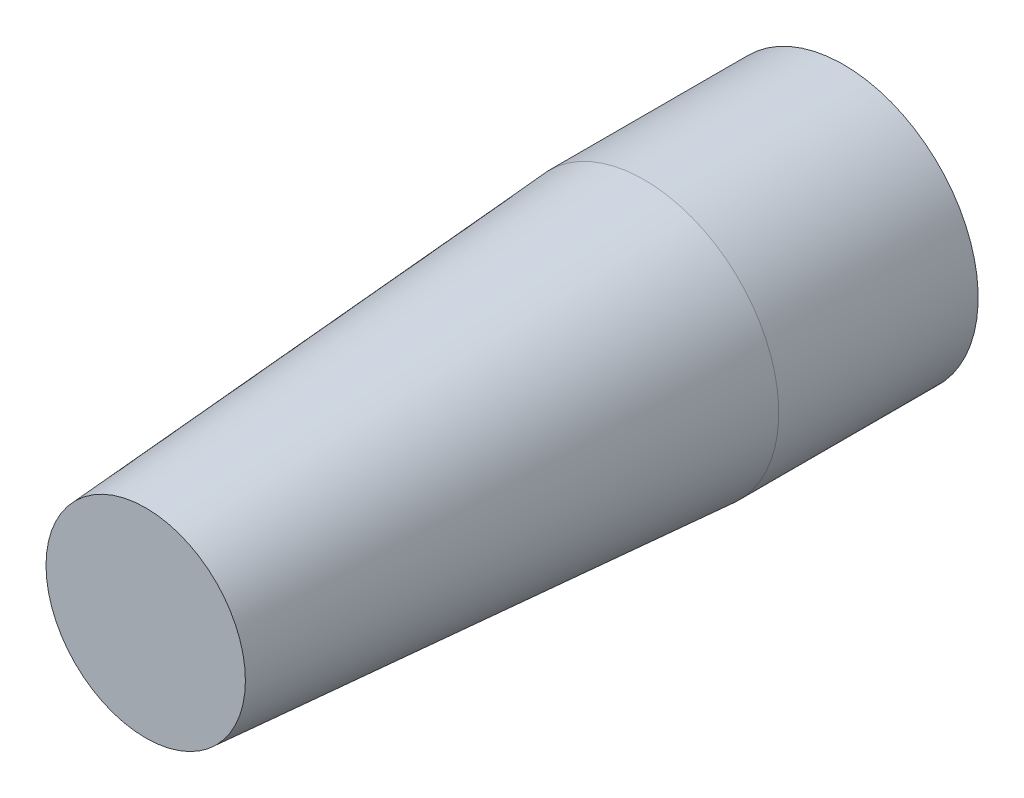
ISO-10303-21;
HEADER;
FILE_DESCRIPTION(('STEP AP214'),'2;1');
FILE_NAME('part.step','',(''),(''),'','','');
FILE_SCHEMA(('AUTOMOTIVE_DESIGN { 1 0 10303 214 1 1 1 1 }'));
ENDSEC;
DATA;
#1=APPLICATION_CONTEXT('core data for automotive mechanical design processes');
#2=APPLICATION_PROTOCOL_DEFINITION('international standard','automotive_design',2000,#1);
#3=PRODUCT_CONTEXT('',#1,'mechanical');
#4=PRODUCT('Part','Part','',(#3));
#5=PRODUCT_RELATED_PRODUCT_CATEGORY('part','',(#4));
#6=PRODUCT_DEFINITION_FORMATION('','',#4);
#7=PRODUCT_DEFINITION_CONTEXT('part definition',#1,'design');
#8=PRODUCT_DEFINITION('design','',#6,#7);
#9=PRODUCT_DEFINITION_SHAPE('','',#8);
#10=(LENGTH_UNIT() NAMED_UNIT(*) SI_UNIT(.MILLI.,.METRE.));
#11=(NAMED_UNIT(*) PLANE_ANGLE_UNIT() SI_UNIT($,.RADIAN.));
#12=(NAMED_UNIT(*) SI_UNIT($,.STERADIAN.) SOLID_ANGLE_UNIT());
#13=UNCERTAINTY_MEASURE_WITH_UNIT(LENGTH_MEASURE(1.E-05),#10,'distance_accuracy_value','');
#14=(GEOMETRIC_REPRESENTATION_CONTEXT(3) GLOBAL_UNCERTAINTY_ASSIGNED_CONTEXT((#13)) GLOBAL_UNIT_ASSIGNED_CONTEXT((#10,
#11,#12)) REPRESENTATION_CONTEXT('',''));
#15=CARTESIAN_POINT('',(0.,0.,0.));
#16=DIRECTION('',(0.,0.,1.));
#17=DIRECTION('',(1.,0.,0.));
#18=AXIS2_PLACEMENT_3D('',#15,#16,#17);
#19=CARTESIAN_POINT('',(0.,0.,0.));
#20=DIRECTION('',(0.,0.,-1.));
#21=DIRECTION('',(-1.,0.,0.));
#22=AXIS2_PLACEMENT_3D('',#19,#20,#21);
#23=CONICAL_SURFACE('',#22,13.5,0.0698860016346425);
#24=CARTESIAN_POINT('',(0.,0.,50.));
#25=DIRECTION('',(0.,0.,1.));
#26=DIRECTION('',(1.,0.,0.));
#27=AXIS2_PLACEMENT_3D('',#24,#25,#26);
#28=CIRCLE('',#27,10.);
#29=CARTESIAN_POINT('',(10.,0.,50.));
#30=VERTEX_POINT('',#29);
#31=EDGE_CURVE('E10',#30,#30,#28,.T.);
#32=ORIENTED_EDGE('',*,*,#31,.F.);
#33=EDGE_LOOP('',(#32));
#34=FACE_BOUND('',#33,.T.);
#35=CARTESIAN_POINT('',(0.,0.,0.));
#36=DIRECTION('',(0.,0.,-1.));
#37=DIRECTION('',(-1.,0.,0.));
#38=AXIS2_PLACEMENT_3D('',#35,#36,#37);
#39=CIRCLE('',#38,13.5);
#40=CARTESIAN_POINT('',(-13.5,0.,0.));
#41=VERTEX_POINT('',#40);
#42=EDGE_CURVE('E47',#41,#41,#39,.T.);
#43=ORIENTED_EDGE('',*,*,#42,.F.);
#44=EDGE_LOOP('',(#43));
#45=FACE_BOUND('',#44,.T.);
#46=ADVANCED_FACE('F37',(#34,#45),#23,.T.);
#47=CARTESIAN_POINT('',(0.,10.,50.));
#48=DIRECTION('',(0.,0.,-1.));
#49=DIRECTION('',(-1.,0.,0.));
#50=AXIS2_PLACEMENT_3D('',#47,#48,#49);
#51=PLANE('',#50);
#52=ORIENTED_EDGE('',*,*,#31,.T.);
#53=EDGE_LOOP('',(#52));
#54=FACE_BOUND('',#53,.T.);
#55=ADVANCED_FACE('F57',(#54),#51,.F.);
#56=CARTESIAN_POINT('',(0.,0.,-20.));
#57=DIRECTION('',(0.,0.,1.));
#58=DIRECTION('',(1.,0.,0.));
#59=AXIS2_PLACEMENT_3D('',#56,#57,#58);
#60=CYLINDRICAL_SURFACE('',#59,13.5);
#61=CARTESIAN_POINT('',(0.,0.,-20.));
#62=DIRECTION('',(0.,0.,-1.));
#63=DIRECTION('',(-1.,0.,0.));
#64=AXIS2_PLACEMENT_3D('',#61,#62,#63);
#65=CIRCLE('',#64,13.5);
#66=CARTESIAN_POINT('',(-13.5,0.,-20.));
#67=VERTEX_POINT('',#66);
#68=EDGE_CURVE('E43',#67,#67,#65,.T.);
#69=ORIENTED_EDGE('',*,*,#68,.F.);
#70=EDGE_LOOP('',(#69));
#71=FACE_BOUND('',#70,.T.);
#72=ORIENTED_EDGE('',*,*,#42,.T.);
#73=EDGE_LOOP('',(#72));
#74=FACE_BOUND('',#73,.T.);
#75=ADVANCED_FACE('F54',(#71,#74),#60,.T.);
#76=CARTESIAN_POINT('',(0.,0.,-20.));
#77=DIRECTION('',(0.,0.,-1.));
#78=DIRECTION('',(-1.,0.,0.));
#79=AXIS2_PLACEMENT_3D('',#76,#77,#78);
#80=PLANE('',#79);
#81=ORIENTED_EDGE('',*,*,#68,.T.);
#82=EDGE_LOOP('',(#81));
#83=FACE_BOUND('',#82,.T.);
#84=ADVANCED_FACE('F65',(#83),#80,.T.);
#85=CLOSED_SHELL('',(#46,#55,#75,#84));
#86=MANIFOLD_SOLID_BREP('B2',#85);
#87=ADVANCED_BREP_SHAPE_REPRESENTATION('',(#18,#86),#14);
#88=SHAPE_DEFINITION_REPRESENTATION(#9,#87);
ENDSEC;
END-ISO-10303-21;
